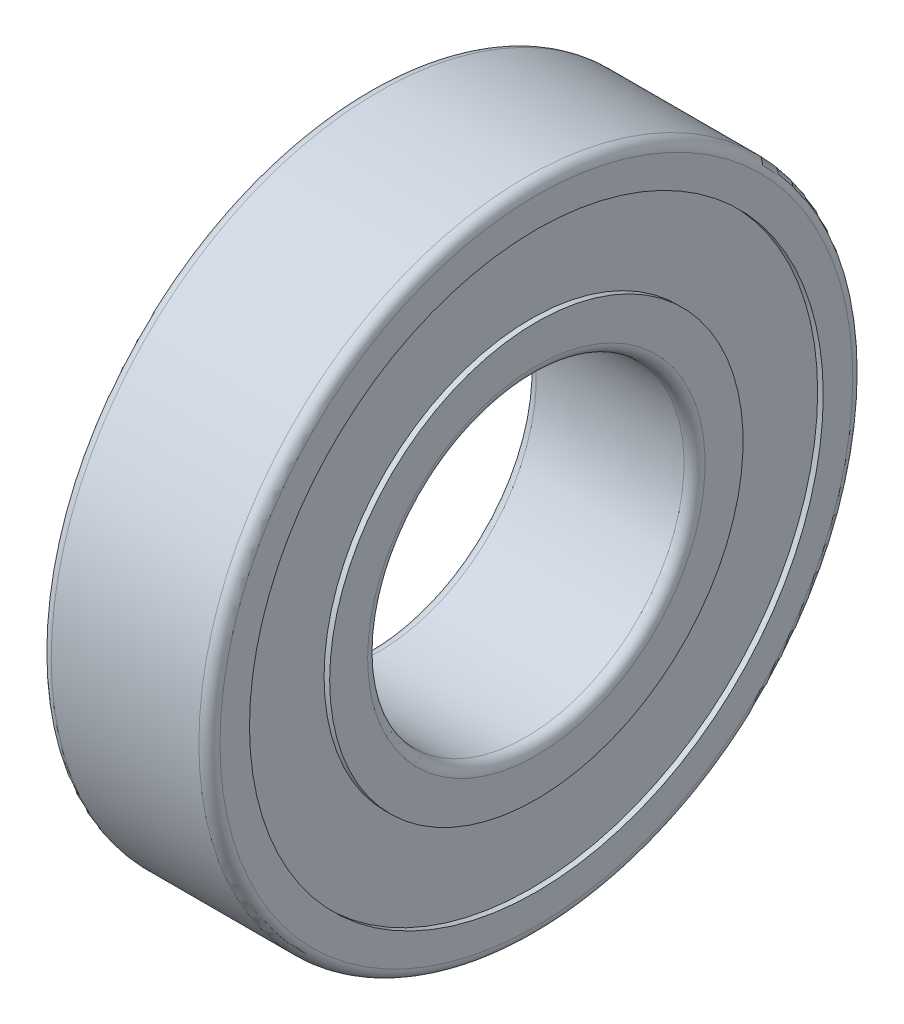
ISO-10303-21;
HEADER;
FILE_DESCRIPTION(('STEP AP214'),'2;1');
FILE_NAME('part.step','',(''),(''),'','','');
FILE_SCHEMA(('AUTOMOTIVE_DESIGN { 1 0 10303 214 1 1 1 1 }'));
ENDSEC;
DATA;
#1=APPLICATION_CONTEXT('core data for automotive mechanical design processes');
#2=APPLICATION_PROTOCOL_DEFINITION('international standard','automotive_design',2000,#1);
#3=PRODUCT_CONTEXT('',#1,'mechanical');
#4=PRODUCT('Part','Part','',(#3));
#5=PRODUCT_RELATED_PRODUCT_CATEGORY('part','',(#4));
#6=PRODUCT_DEFINITION_FORMATION('','',#4);
#7=PRODUCT_DEFINITION_CONTEXT('part definition',#1,'design');
#8=PRODUCT_DEFINITION('design','',#6,#7);
#9=PRODUCT_DEFINITION_SHAPE('','',#8);
#10=(LENGTH_UNIT() NAMED_UNIT(*) SI_UNIT(.MILLI.,.METRE.));
#11=(NAMED_UNIT(*) PLANE_ANGLE_UNIT() SI_UNIT($,.RADIAN.));
#12=(NAMED_UNIT(*) SI_UNIT($,.STERADIAN.) SOLID_ANGLE_UNIT());
#13=UNCERTAINTY_MEASURE_WITH_UNIT(LENGTH_MEASURE(1.E-05),#10,'distance_accuracy_value','');
#14=(GEOMETRIC_REPRESENTATION_CONTEXT(3) GLOBAL_UNCERTAINTY_ASSIGNED_CONTEXT((#13)) GLOBAL_UNIT_ASSIGNED_CONTEXT((#10,
#11,#12)) REPRESENTATION_CONTEXT('',''));
#15=CARTESIAN_POINT('',(0.,0.,0.));
#16=DIRECTION('',(0.,0.,1.));
#17=DIRECTION('',(1.,0.,0.));
#18=AXIS2_PLACEMENT_3D('',#15,#16,#17);
#19=CARTESIAN_POINT('',(0.999999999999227,0.,0.));
#20=DIRECTION('',(-1.,0.,0.));
#21=DIRECTION('',(0.,0.,1.));
#22=AXIS2_PLACEMENT_3D('',#19,#20,#21);
#23=TOROIDAL_SURFACE('',#22,30.0000000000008,0.999999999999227);
#24=CARTESIAN_POINT('',(0.,0.,0.));
#25=DIRECTION('',(-1.,0.,0.));
#26=DIRECTION('',(0.,0.,1.));
#27=AXIS2_PLACEMENT_3D('',#24,#25,#26);
#28=CIRCLE('',#27,30.);
#29=CARTESIAN_POINT('',(0.,0.,30.));
#30=VERTEX_POINT('',#29);
#31=EDGE_CURVE('E10',#30,#30,#28,.T.);
#32=ORIENTED_EDGE('',*,*,#31,.F.);
#33=EDGE_LOOP('',(#32));
#34=FACE_BOUND('',#33,.T.);
#35=CARTESIAN_POINT('',(1.,0.,0.));
#36=DIRECTION('',(-1.,0.,0.));
#37=DIRECTION('',(0.,0.,1.));
#38=AXIS2_PLACEMENT_3D('',#35,#36,#37);
#39=CIRCLE('',#38,31.);
#40=CARTESIAN_POINT('',(1.,0.,31.));
#41=VERTEX_POINT('',#40);
#42=EDGE_CURVE('E106',#41,#41,#39,.T.);
#43=ORIENTED_EDGE('',*,*,#42,.T.);
#44=EDGE_LOOP('',(#43));
#45=FACE_BOUND('',#44,.T.);
#46=ADVANCED_FACE('F38',(#34,#45),#23,.T.);
#47=CARTESIAN_POINT('',(0.,30.,0.));
#48=DIRECTION('',(1.,0.,0.));
#49=DIRECTION('',(0.,0.,-1.));
#50=AXIS2_PLACEMENT_3D('',#47,#48,#49);
#51=PLANE('',#50);
#52=CARTESIAN_POINT('',(0.,0.,0.));
#53=DIRECTION('',(-1.,0.,0.));
#54=DIRECTION('',(0.,0.,1.));
#55=AXIS2_PLACEMENT_3D('',#52,#53,#54);
#56=CIRCLE('',#55,27.2);
#57=CARTESIAN_POINT('',(0.,0.,27.2));
#58=VERTEX_POINT('',#57);
#59=EDGE_CURVE('E45',#58,#58,#56,.T.);
#60=ORIENTED_EDGE('',*,*,#59,.F.);
#61=EDGE_LOOP('',(#60));
#62=FACE_BOUND('',#61,.T.);
#63=ORIENTED_EDGE('',*,*,#31,.T.);
#64=EDGE_LOOP('',(#63));
#65=FACE_BOUND('',#64,.T.);
#66=ADVANCED_FACE('F191',(#62,#65),#51,.F.);
#67=CARTESIAN_POINT('',(16.,0.,0.));
#68=DIRECTION('',(-1.,0.,0.));
#69=DIRECTION('',(0.,0.,1.));
#70=AXIS2_PLACEMENT_3D('',#67,#68,#69);
#71=CYLINDRICAL_SURFACE('',#70,27.2);
#72=CARTESIAN_POINT('',(0.529999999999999,0.,0.));
#73=DIRECTION('',(-1.,0.,0.));
#74=DIRECTION('',(0.,0.,1.));
#75=AXIS2_PLACEMENT_3D('',#72,#73,#74);
#76=CIRCLE('',#75,27.2);
#77=CARTESIAN_POINT('',(0.529999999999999,0.,27.2));
#78=VERTEX_POINT('',#77);
#79=EDGE_CURVE('E51',#78,#78,#76,.T.);
#80=ORIENTED_EDGE('',*,*,#79,.F.);
#81=EDGE_LOOP('',(#80));
#82=FACE_BOUND('',#81,.T.);
#83=ORIENTED_EDGE('',*,*,#59,.T.);
#84=EDGE_LOOP('',(#83));
#85=FACE_BOUND('',#84,.T.);
#86=ADVANCED_FACE('F186',(#82,#85),#71,.F.);
#87=CARTESIAN_POINT('',(0.53,27.2,0.));
#88=DIRECTION('',(1.,0.,0.));
#89=DIRECTION('',(0.,0.,-1.));
#90=AXIS2_PLACEMENT_3D('',#87,#88,#89);
#91=PLANE('',#90);
#92=CARTESIAN_POINT('',(0.529999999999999,0.,0.));
#93=DIRECTION('',(-1.,0.,0.));
#94=DIRECTION('',(0.,0.,1.));
#95=AXIS2_PLACEMENT_3D('',#92,#93,#94);
#96=CIRCLE('',#95,19.6);
#97=CARTESIAN_POINT('',(0.529999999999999,0.,19.6));
#98=VERTEX_POINT('',#97);
#99=EDGE_CURVE('E56',#98,#98,#96,.T.);
#100=ORIENTED_EDGE('',*,*,#99,.F.);
#101=EDGE_LOOP('',(#100));
#102=FACE_BOUND('',#101,.T.);
#103=ORIENTED_EDGE('',*,*,#79,.T.);
#104=EDGE_LOOP('',(#103));
#105=FACE_BOUND('',#104,.T.);
#106=ADVANCED_FACE('F180',(#102,#105),#91,.F.);
#107=CARTESIAN_POINT('',(16.,0.,0.));
#108=DIRECTION('',(-1.,0.,0.));
#109=DIRECTION('',(0.,0.,1.));
#110=AXIS2_PLACEMENT_3D('',#107,#108,#109);
#111=CYLINDRICAL_SURFACE('',#110,19.6);
#112=CARTESIAN_POINT('',(0.,0.,0.));
#113=DIRECTION('',(-1.,0.,0.));
#114=DIRECTION('',(0.,0.,1.));
#115=AXIS2_PLACEMENT_3D('',#112,#113,#114);
#116=CIRCLE('',#115,19.6);
#117=CARTESIAN_POINT('',(0.,0.,19.6));
#118=VERTEX_POINT('',#117);
#119=EDGE_CURVE('E62',#118,#118,#116,.T.);
#120=ORIENTED_EDGE('',*,*,#119,.F.);
#121=EDGE_LOOP('',(#120));
#122=FACE_BOUND('',#121,.T.);
#123=ORIENTED_EDGE('',*,*,#99,.T.);
#124=EDGE_LOOP('',(#123));
#125=FACE_BOUND('',#124,.T.);
#126=ADVANCED_FACE('F174',(#122,#125),#111,.T.);
#127=CARTESIAN_POINT('',(0.,19.6,0.));
#128=DIRECTION('',(1.,0.,0.));
#129=DIRECTION('',(0.,0.,-1.));
#130=AXIS2_PLACEMENT_3D('',#127,#128,#129);
#131=PLANE('',#130);
#132=CARTESIAN_POINT('',(0.,0.,0.));
#133=DIRECTION('',(-1.,0.,0.));
#134=DIRECTION('',(0.,0.,1.));
#135=AXIS2_PLACEMENT_3D('',#132,#133,#134);
#136=CIRCLE('',#135,16.);
#137=CARTESIAN_POINT('',(0.,0.,16.));
#138=VERTEX_POINT('',#137);
#139=EDGE_CURVE('E66',#138,#138,#136,.T.);
#140=ORIENTED_EDGE('',*,*,#139,.F.);
#141=EDGE_LOOP('',(#140));
#142=FACE_BOUND('',#141,.T.);
#143=ORIENTED_EDGE('',*,*,#119,.T.);
#144=EDGE_LOOP('',(#143));
#145=FACE_BOUND('',#144,.T.);
#146=ADVANCED_FACE('F168',(#142,#145),#131,.F.);
#147=CARTESIAN_POINT('',(0.999999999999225,0.,0.));
#148=DIRECTION('',(-1.,0.,0.));
#149=DIRECTION('',(0.,0.,1.));
#150=AXIS2_PLACEMENT_3D('',#147,#148,#149);
#151=TOROIDAL_SURFACE('',#150,15.9999999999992,0.999999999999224);
#152=CARTESIAN_POINT('',(0.999999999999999,0.,0.));
#153=DIRECTION('',(-1.,0.,0.));
#154=DIRECTION('',(0.,0.,1.));
#155=AXIS2_PLACEMENT_3D('',#152,#153,#154);
#156=CIRCLE('',#155,15.);
#157=CARTESIAN_POINT('',(0.999999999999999,0.,15.));
#158=VERTEX_POINT('',#157);
#159=EDGE_CURVE('E70',#158,#158,#156,.T.);
#160=ORIENTED_EDGE('',*,*,#159,.F.);
#161=EDGE_LOOP('',(#160));
#162=FACE_BOUND('',#161,.T.);
#163=ORIENTED_EDGE('',*,*,#139,.T.);
#164=EDGE_LOOP('',(#163));
#165=FACE_BOUND('',#164,.T.);
#166=ADVANCED_FACE('F162',(#162,#165),#151,.T.);
#167=CARTESIAN_POINT('',(16.,0.,0.));
#168=DIRECTION('',(-1.,0.,0.));
#169=DIRECTION('',(0.,0.,1.));
#170=AXIS2_PLACEMENT_3D('',#167,#168,#169);
#171=CYLINDRICAL_SURFACE('',#170,15.);
#172=CARTESIAN_POINT('',(15.,0.,0.));
#173=DIRECTION('',(-1.,0.,0.));
#174=DIRECTION('',(0.,0.,1.));
#175=AXIS2_PLACEMENT_3D('',#172,#173,#174);
#176=CIRCLE('',#175,15.);
#177=CARTESIAN_POINT('',(15.,0.,15.));
#178=VERTEX_POINT('',#177);
#179=EDGE_CURVE('E74',#178,#178,#176,.T.);
#180=ORIENTED_EDGE('',*,*,#179,.F.);
#181=EDGE_LOOP('',(#180));
#182=FACE_BOUND('',#181,.T.);
#183=ORIENTED_EDGE('',*,*,#159,.T.);
#184=EDGE_LOOP('',(#183));
#185=FACE_BOUND('',#184,.T.);
#186=ADVANCED_FACE('F156',(#182,#185),#171,.F.);
#187=CARTESIAN_POINT('',(15.0000000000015,0.,0.));
#188=DIRECTION('',(-1.,0.,0.));
#189=DIRECTION('',(0.,0.,1.));
#190=AXIS2_PLACEMENT_3D('',#187,#188,#189);
#191=TOROIDAL_SURFACE('',#190,15.9999999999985,0.99999999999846);
#192=CARTESIAN_POINT('',(16.,0.,0.));
#193=DIRECTION('',(-1.,0.,0.));
#194=DIRECTION('',(0.,0.,1.));
#195=AXIS2_PLACEMENT_3D('',#192,#193,#194);
#196=CIRCLE('',#195,16.);
#197=CARTESIAN_POINT('',(16.,0.,16.));
#198=VERTEX_POINT('',#197);
#199=EDGE_CURVE('E78',#198,#198,#196,.T.);
#200=ORIENTED_EDGE('',*,*,#199,.F.);
#201=EDGE_LOOP('',(#200));
#202=FACE_BOUND('',#201,.T.);
#203=ORIENTED_EDGE('',*,*,#179,.T.);
#204=EDGE_LOOP('',(#203));
#205=FACE_BOUND('',#204,.T.);
#206=ADVANCED_FACE('F150',(#202,#205),#191,.T.);
#207=CARTESIAN_POINT('',(16.,16.,0.));
#208=DIRECTION('',(-1.,0.,0.));
#209=DIRECTION('',(0.,0.,1.));
#210=AXIS2_PLACEMENT_3D('',#207,#208,#209);
#211=PLANE('',#210);
#212=CARTESIAN_POINT('',(16.,0.,0.));
#213=DIRECTION('',(-1.,0.,0.));
#214=DIRECTION('',(0.,0.,1.));
#215=AXIS2_PLACEMENT_3D('',#212,#213,#214);
#216=CIRCLE('',#215,19.6);
#217=CARTESIAN_POINT('',(16.,0.,19.6));
#218=VERTEX_POINT('',#217);
#219=EDGE_CURVE('E82',#218,#218,#216,.T.);
#220=ORIENTED_EDGE('',*,*,#219,.F.);
#221=EDGE_LOOP('',(#220));
#222=FACE_BOUND('',#221,.T.);
#223=ORIENTED_EDGE('',*,*,#199,.T.);
#224=EDGE_LOOP('',(#223));
#225=FACE_BOUND('',#224,.T.);
#226=ADVANCED_FACE('F144',(#222,#225),#211,.F.);
#227=CARTESIAN_POINT('',(16.,0.,0.));
#228=DIRECTION('',(-1.,0.,0.));
#229=DIRECTION('',(0.,0.,1.));
#230=AXIS2_PLACEMENT_3D('',#227,#228,#229);
#231=CYLINDRICAL_SURFACE('',#230,19.6);
#232=CARTESIAN_POINT('',(15.47,0.,0.));
#233=DIRECTION('',(-1.,0.,0.));
#234=DIRECTION('',(0.,0.,1.));
#235=AXIS2_PLACEMENT_3D('',#232,#233,#234);
#236=CIRCLE('',#235,19.6);
#237=CARTESIAN_POINT('',(15.47,0.,19.6));
#238=VERTEX_POINT('',#237);
#239=EDGE_CURVE('E86',#238,#238,#236,.T.);
#240=ORIENTED_EDGE('',*,*,#239,.F.);
#241=EDGE_LOOP('',(#240));
#242=FACE_BOUND('',#241,.T.);
#243=ORIENTED_EDGE('',*,*,#219,.T.);
#244=EDGE_LOOP('',(#243));
#245=FACE_BOUND('',#244,.T.);
#246=ADVANCED_FACE('F138',(#242,#245),#231,.T.);
#247=CARTESIAN_POINT('',(15.47,19.6,0.));
#248=DIRECTION('',(-1.,0.,0.));
#249=DIRECTION('',(0.,0.,1.));
#250=AXIS2_PLACEMENT_3D('',#247,#248,#249);
#251=PLANE('',#250);
#252=CARTESIAN_POINT('',(15.47,0.,0.));
#253=DIRECTION('',(-1.,0.,0.));
#254=DIRECTION('',(0.,0.,1.));
#255=AXIS2_PLACEMENT_3D('',#252,#253,#254);
#256=CIRCLE('',#255,27.2);
#257=CARTESIAN_POINT('',(15.47,0.,27.2));
#258=VERTEX_POINT('',#257);
#259=EDGE_CURVE('E90',#258,#258,#256,.T.);
#260=ORIENTED_EDGE('',*,*,#259,.F.);
#261=EDGE_LOOP('',(#260));
#262=FACE_BOUND('',#261,.T.);
#263=ORIENTED_EDGE('',*,*,#239,.T.);
#264=EDGE_LOOP('',(#263));
#265=FACE_BOUND('',#264,.T.);
#266=ADVANCED_FACE('F132',(#262,#265),#251,.F.);
#267=CARTESIAN_POINT('',(16.,0.,0.));
#268=DIRECTION('',(-1.,0.,0.));
#269=DIRECTION('',(0.,0.,1.));
#270=AXIS2_PLACEMENT_3D('',#267,#268,#269);
#271=CYLINDRICAL_SURFACE('',#270,27.2);
#272=CARTESIAN_POINT('',(16.,0.,0.));
#273=DIRECTION('',(-1.,0.,0.));
#274=DIRECTION('',(0.,0.,1.));
#275=AXIS2_PLACEMENT_3D('',#272,#273,#274);
#276=CIRCLE('',#275,27.2);
#277=CARTESIAN_POINT('',(16.,0.,27.2));
#278=VERTEX_POINT('',#277);
#279=EDGE_CURVE('E94',#278,#278,#276,.T.);
#280=ORIENTED_EDGE('',*,*,#279,.F.);
#281=EDGE_LOOP('',(#280));
#282=FACE_BOUND('',#281,.T.);
#283=ORIENTED_EDGE('',*,*,#259,.T.);
#284=EDGE_LOOP('',(#283));
#285=FACE_BOUND('',#284,.T.);
#286=ADVANCED_FACE('F126',(#282,#285),#271,.F.);
#287=CARTESIAN_POINT('',(16.,27.2,0.));
#288=DIRECTION('',(-1.,0.,0.));
#289=DIRECTION('',(0.,0.,1.));
#290=AXIS2_PLACEMENT_3D('',#287,#288,#289);
#291=PLANE('',#290);
#292=CARTESIAN_POINT('',(16.,0.,0.));
#293=DIRECTION('',(-1.,0.,0.));
#294=DIRECTION('',(0.,0.,1.));
#295=AXIS2_PLACEMENT_3D('',#292,#293,#294);
#296=CIRCLE('',#295,30.);
#297=CARTESIAN_POINT('',(16.,0.,30.));
#298=VERTEX_POINT('',#297);
#299=EDGE_CURVE('E98',#298,#298,#296,.T.);
#300=ORIENTED_EDGE('',*,*,#299,.F.);
#301=EDGE_LOOP('',(#300));
#302=FACE_BOUND('',#301,.T.);
#303=ORIENTED_EDGE('',*,*,#279,.T.);
#304=EDGE_LOOP('',(#303));
#305=FACE_BOUND('',#304,.T.);
#306=ADVANCED_FACE('F120',(#302,#305),#291,.F.);
#307=CARTESIAN_POINT('',(15.0000000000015,0.,0.));
#308=DIRECTION('',(-1.,0.,0.));
#309=DIRECTION('',(0.,0.,1.));
#310=AXIS2_PLACEMENT_3D('',#307,#308,#309);
#311=TOROIDAL_SURFACE('',#310,30.0000000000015,0.999999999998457);
#312=CARTESIAN_POINT('',(15.,0.,0.));
#313=DIRECTION('',(-1.,0.,0.));
#314=DIRECTION('',(0.,0.,1.));
#315=AXIS2_PLACEMENT_3D('',#312,#313,#314);
#316=CIRCLE('',#315,31.);
#317=CARTESIAN_POINT('',(15.,0.,31.));
#318=VERTEX_POINT('',#317);
#319=EDGE_CURVE('E102',#318,#318,#316,.T.);
#320=ORIENTED_EDGE('',*,*,#319,.F.);
#321=EDGE_LOOP('',(#320));
#322=FACE_BOUND('',#321,.T.);
#323=ORIENTED_EDGE('',*,*,#299,.T.);
#324=EDGE_LOOP('',(#323));
#325=FACE_BOUND('',#324,.T.);
#326=ADVANCED_FACE('F114',(#322,#325),#311,.T.);
#327=CARTESIAN_POINT('',(16.,0.,0.));
#328=DIRECTION('',(-1.,0.,0.));
#329=DIRECTION('',(0.,0.,1.));
#330=AXIS2_PLACEMENT_3D('',#327,#328,#329);
#331=CYLINDRICAL_SURFACE('',#330,31.);
#332=ORIENTED_EDGE('',*,*,#42,.F.);
#333=EDGE_LOOP('',(#332));
#334=FACE_BOUND('',#333,.T.);
#335=ORIENTED_EDGE('',*,*,#319,.T.);
#336=EDGE_LOOP('',(#335));
#337=FACE_BOUND('',#336,.T.);
#338=ADVANCED_FACE('F111',(#334,#337),#331,.T.);
#339=CLOSED_SHELL('',(#46,#66,#86,#106,#126,#146,#166,#186,#206,#226,#246,#266,#286,#306,#326,#338));
#340=MANIFOLD_SOLID_BREP('B2',#339);
#341=ADVANCED_BREP_SHAPE_REPRESENTATION('',(#18,#340),#14);
#342=SHAPE_DEFINITION_REPRESENTATION(#9,#341);
ENDSEC;
END-ISO-10303-21;
